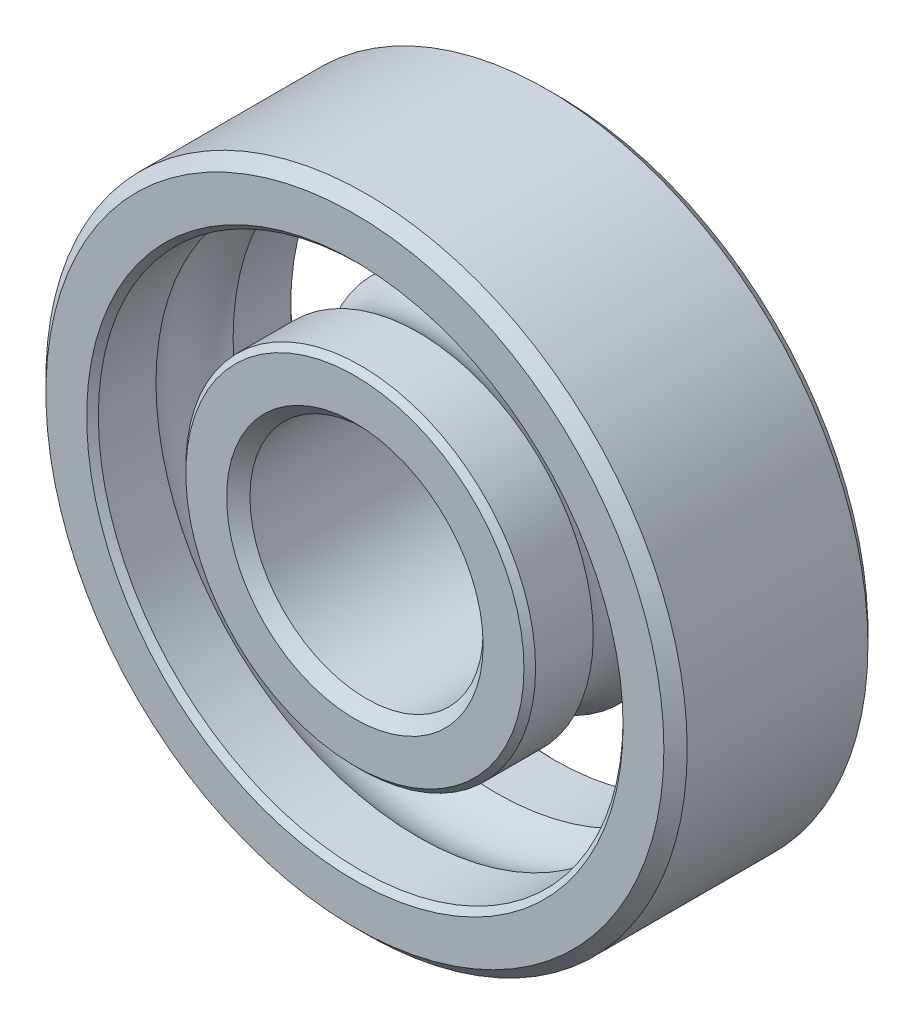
from build123d import *

# Parameters (mm, degrees)
CHAMFER_2_SIZE = 0.4
CHAMFER_3_SIZE = 0.2
CHAMFER_4_SIZE = 0.2
CHAMFER_5_SIZE = 0.4


with BuildPart() as part:
    # Sketch 1 → Revolve 1 (revolve)
    with BuildSketch(Plane(origin=(0, 0, 0), x_dir=(1, 0, 0), z_dir=(0, 1, 0))):
        with BuildLine():
            Line((4, 3.5), (6, 3.5))
            Line((6, 3.5), (6, 1.322875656))
            ThreePointArc((6, 1.322875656), (5.5, 0), (6, -1.322875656))
            Line((6, -1.322875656), (6, -3.5))
            Line((6, -3.5), (4, -3.5))
            Line((4, -3.5), (4, 3.5))
        make_face()
        with BuildLine():
            Line((9, 3.5), (9, 1.322875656))
            ThreePointArc((9, 1.322875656), (9.5, 0), (9, -1.322875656))
            Line((9, -1.322875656), (9, -3.5))
            Line((9, -3.5), (11, -3.5))
            Line((11, -3.5), (11, 3.5))
            Line((11, 3.5), (9, 3.5))
        make_face()
    revolve(axis=Axis((0, 0, 0), (0, 0, -1)))

    # Chamfer 2
    chamfer_2_edges = [part.edges().sort_by_distance(p)[0] for p in [
        (-4, 0, 3.5),
        (-4, 0, -3.5),
    ]]
    chamfer(chamfer_2_edges, length=CHAMFER_2_SIZE)

    # Chamfer 3
    chamfer_3_edges = [part.edges().sort_by_distance(p)[0] for p in [
        (-6, 0, 3.5),
        (-6, 0, -3.5),
    ]]
    chamfer(chamfer_3_edges, length=CHAMFER_3_SIZE)

    # Chamfer 4
    chamfer_4_edges = [part.edges().sort_by_distance(p)[0] for p in [
        (-9, 0, -3.5),
        (-9, 0, 3.5),
    ]]
    chamfer(chamfer_4_edges, length=CHAMFER_4_SIZE)

    # Chamfer 5
    chamfer_5_edges = [part.edges().sort_by_distance(p)[0] for p in [
        (-11, 0, -3.5),
        (-11, 0, 3.5),
    ]]
    chamfer(chamfer_5_edges, length=CHAMFER_5_SIZE)


solid = part.part
